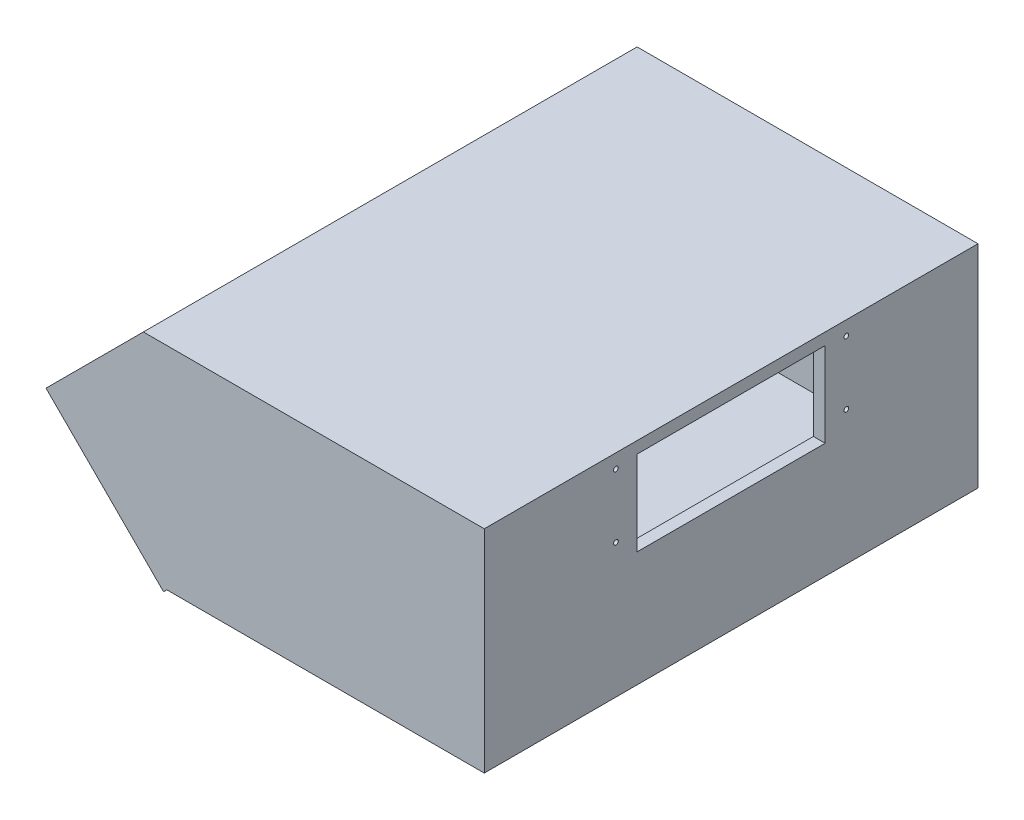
ISO-10303-21;
HEADER;
FILE_DESCRIPTION(('STEP AP214'),'2;1');
FILE_NAME('part.step','',(''),(''),'','','');
FILE_SCHEMA(('AUTOMOTIVE_DESIGN { 1 0 10303 214 1 1 1 1 }'));
ENDSEC;
DATA;
#1=APPLICATION_CONTEXT('core data for automotive mechanical design processes');
#2=APPLICATION_PROTOCOL_DEFINITION('international standard','automotive_design',2000,#1);
#3=PRODUCT_CONTEXT('',#1,'mechanical');
#4=PRODUCT('Part','Part','',(#3));
#5=PRODUCT_RELATED_PRODUCT_CATEGORY('part','',(#4));
#6=PRODUCT_DEFINITION_FORMATION('','',#4);
#7=PRODUCT_DEFINITION_CONTEXT('part definition',#1,'design');
#8=PRODUCT_DEFINITION('design','',#6,#7);
#9=PRODUCT_DEFINITION_SHAPE('','',#8);
#10=(LENGTH_UNIT() NAMED_UNIT(*) SI_UNIT(.MILLI.,.METRE.));
#11=(NAMED_UNIT(*) PLANE_ANGLE_UNIT() SI_UNIT($,.RADIAN.));
#12=(NAMED_UNIT(*) SI_UNIT($,.STERADIAN.) SOLID_ANGLE_UNIT());
#13=UNCERTAINTY_MEASURE_WITH_UNIT(LENGTH_MEASURE(1.E-05),#10,'distance_accuracy_value','');
#14=(GEOMETRIC_REPRESENTATION_CONTEXT(3) GLOBAL_UNCERTAINTY_ASSIGNED_CONTEXT((#13)) GLOBAL_UNIT_ASSIGNED_CONTEXT((#10,
#11,#12)) REPRESENTATION_CONTEXT('',''));
#15=CARTESIAN_POINT('',(0.,0.,0.));
#16=DIRECTION('',(0.,0.,1.));
#17=DIRECTION('',(1.,0.,0.));
#18=AXIS2_PLACEMENT_3D('',#15,#16,#17);
#19=CARTESIAN_POINT('',(180.,87.6256799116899,90.6250000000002));
#20=DIRECTION('',(0.,0.,-1.));
#21=DIRECTION('',(0.,1.,0.));
#22=AXIS2_PLACEMENT_3D('',#19,#20,#21);
#23=PLANE('',#22);
#24=DIRECTION('',(-1.,0.,0.));
#25=VECTOR('',#24,1.);
#26=CARTESIAN_POINT('',(180.,7.62567991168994,90.6250000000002));
#27=LINE('',#26,#25);
#28=CARTESIAN_POINT('',(180.,7.62567991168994,90.6250000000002));
#29=VERTEX_POINT('',#28);
#30=CARTESIAN_POINT('',(50.0000000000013,7.62567991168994,90.6250000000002));
#31=VERTEX_POINT('',#30);
#32=EDGE_CURVE('E305',#29,#31,#27,.T.);
#33=ORIENTED_EDGE('',*,*,#32,.T.);
#34=CARTESIAN_POINT('',(50.0000000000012,2.62567991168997,90.6250000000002));
#35=DIRECTION('',(0.,0.,-1.));
#36=DIRECTION('',(0.,1.,0.));
#37=AXIS2_PLACEMENT_3D('',#34,#35,#36);
#38=CIRCLE('',#37,5.);
#39=CARTESIAN_POINT('',(46.4644660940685,6.16121381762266,90.6250000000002));
#40=VERTEX_POINT('',#39);
#41=EDGE_CURVE('E41',#31,#40,#38,.F.);
#42=ORIENTED_EDGE('',*,*,#41,.T.);
#43=DIRECTION('',(0.707106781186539,0.707106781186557,0.));
#44=VECTOR('',#43,1.);
#45=CARTESIAN_POINT('',(45.0502525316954,4.74700025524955,90.6250000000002));
#46=LINE('',#45,#44);
#47=CARTESIAN_POINT('',(45.0502525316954,4.74700025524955,90.6250000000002));
#48=VERTEX_POINT('',#47);
#49=EDGE_CURVE('E183',#48,#40,#46,.T.);
#50=ORIENTED_EDGE('',*,*,#49,.F.);
#51=DIRECTION('',(-0.707106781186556,0.707106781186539,0.));
#52=VECTOR('',#51,1.);
#53=CARTESIAN_POINT('',(2.12132034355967,47.6759324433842,90.6250000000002));
#54=LINE('',#53,#52);
#55=CARTESIAN_POINT('',(2.12132034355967,47.6759324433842,90.6250000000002));
#56=VERTEX_POINT('',#55);
#57=EDGE_CURVE('E180',#48,#56,#54,.T.);
#58=ORIENTED_EDGE('',*,*,#57,.T.);
#59=DIRECTION('',(0.707106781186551,0.707106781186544,0.));
#60=VECTOR('',#59,1.);
#61=CARTESIAN_POINT('',(111.035533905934,156.590146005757,90.6250000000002));
#62=LINE('',#61,#60);
#63=CARTESIAN_POINT('',(42.0710678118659,87.6256799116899,90.6250000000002));
#64=VERTEX_POINT('',#63);
#65=EDGE_CURVE('E163',#56,#64,#62,.T.);
#66=ORIENTED_EDGE('',*,*,#65,.T.);
#67=DIRECTION('',(-1.,0.,0.));
#68=VECTOR('',#67,1.);
#69=CARTESIAN_POINT('',(180.,87.6256799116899,90.6250000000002));
#70=LINE('',#69,#68);
#71=CARTESIAN_POINT('',(180.,87.6256799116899,90.6250000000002));
#72=VERTEX_POINT('',#71);
#73=EDGE_CURVE('E295',#72,#64,#70,.T.);
#74=ORIENTED_EDGE('',*,*,#73,.F.);
#75=DIRECTION('',(0.,-1.,0.));
#76=VECTOR('',#75,1.);
#77=CARTESIAN_POINT('',(180.,87.6256799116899,90.6250000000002));
#78=LINE('',#77,#76);
#79=EDGE_CURVE('E282',#72,#29,#78,.T.);
#80=ORIENTED_EDGE('',*,*,#79,.T.);
#81=EDGE_LOOP('',(#33,#42,#50,#58,#66,#74,#80));
#82=FACE_BOUND('',#81,.T.);
#83=ADVANCED_FACE('F33',(#82),#23,.T.);
#84=CARTESIAN_POINT('',(180.,87.6256799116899,-109.375));
#85=DIRECTION('',(0.,0.,1.));
#86=DIRECTION('',(0.,-1.,0.));
#87=AXIS2_PLACEMENT_3D('',#84,#85,#86);
#88=PLANE('',#87);
#89=DIRECTION('',(-1.,0.,0.));
#90=VECTOR('',#89,1.);
#91=CARTESIAN_POINT('',(180.,87.6256799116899,-109.375));
#92=LINE('',#91,#90);
#93=CARTESIAN_POINT('',(180.,87.6256799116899,-109.375));
#94=VERTEX_POINT('',#93);
#95=CARTESIAN_POINT('',(42.0710678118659,87.6256799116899,-109.375));
#96=VERTEX_POINT('',#95);
#97=EDGE_CURVE('E299',#94,#96,#92,.T.);
#98=ORIENTED_EDGE('',*,*,#97,.T.);
#99=DIRECTION('',(-0.707106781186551,-0.707106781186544,0.));
#100=VECTOR('',#99,1.);
#101=CARTESIAN_POINT('',(111.035533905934,156.590146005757,-109.375));
#102=LINE('',#101,#100);
#103=CARTESIAN_POINT('',(3.53553390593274,49.0901460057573,-109.375));
#104=VERTEX_POINT('',#103);
#105=EDGE_CURVE('E176',#96,#104,#102,.T.);
#106=ORIENTED_EDGE('',*,*,#105,.T.);
#107=DIRECTION('',(0.707106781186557,-0.707106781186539,0.));
#108=VECTOR('',#107,1.);
#109=CARTESIAN_POINT('',(72.5000000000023,-19.8743200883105,-109.375));
#110=LINE('',#109,#108);
#111=CARTESIAN_POINT('',(46.4644660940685,6.16121381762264,-109.375));
#112=VERTEX_POINT('',#111);
#113=EDGE_CURVE('E231',#104,#112,#110,.T.);
#114=ORIENTED_EDGE('',*,*,#113,.T.);
#115=CARTESIAN_POINT('',(50.0000000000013,2.62567991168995,-109.375));
#116=DIRECTION('',(0.,0.,1.));
#117=DIRECTION('',(0.,-1.,0.));
#118=AXIS2_PLACEMENT_3D('',#115,#116,#117);
#119=CIRCLE('',#118,5.);
#120=CARTESIAN_POINT('',(50.0000000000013,7.62567991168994,-109.375));
#121=VERTEX_POINT('',#120);
#122=EDGE_CURVE('E11',#112,#121,#119,.F.);
#123=ORIENTED_EDGE('',*,*,#122,.T.);
#124=DIRECTION('',(-1.,0.,0.));
#125=VECTOR('',#124,1.);
#126=CARTESIAN_POINT('',(180.,7.62567991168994,-109.375));
#127=LINE('',#126,#125);
#128=CARTESIAN_POINT('',(180.,7.62567991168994,-109.375));
#129=VERTEX_POINT('',#128);
#130=EDGE_CURVE('E302',#129,#121,#127,.T.);
#131=ORIENTED_EDGE('',*,*,#130,.F.);
#132=DIRECTION('',(0.,1.,0.));
#133=VECTOR('',#132,1.);
#134=CARTESIAN_POINT('',(180.,87.6256799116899,-109.375));
#135=LINE('',#134,#133);
#136=EDGE_CURVE('E288',#129,#94,#135,.T.);
#137=ORIENTED_EDGE('',*,*,#136,.T.);
#138=EDGE_LOOP('',(#98,#106,#114,#123,#131,#137));
#139=FACE_BOUND('',#138,.T.);
#140=ADVANCED_FACE('F331',(#139),#88,.T.);
#141=CARTESIAN_POINT('',(180.,87.6256799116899,90.6250000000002));
#142=DIRECTION('',(0.,-1.,0.));
#143=DIRECTION('',(0.,0.,-1.));
#144=AXIS2_PLACEMENT_3D('',#141,#142,#143);
#145=PLANE('',#144);
#146=ORIENTED_EDGE('',*,*,#73,.T.);
#147=DIRECTION('',(0.,0.,-1.));
#148=VECTOR('',#147,1.);
#149=CARTESIAN_POINT('',(42.0710678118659,87.6256799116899,90.6250000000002));
#150=LINE('',#149,#148);
#151=EDGE_CURVE('E171',#64,#96,#150,.T.);
#152=ORIENTED_EDGE('',*,*,#151,.T.);
#153=ORIENTED_EDGE('',*,*,#97,.F.);
#154=DIRECTION('',(0.,0.,1.));
#155=VECTOR('',#154,1.);
#156=CARTESIAN_POINT('',(180.,87.6256799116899,90.6250000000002));
#157=LINE('',#156,#155);
#158=CARTESIAN_POINT('',(180.,87.6256799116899,-58.3749999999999));
#159=VERTEX_POINT('',#158);
#160=EDGE_CURVE('E292',#94,#159,#157,.T.);
#161=ORIENTED_EDGE('',*,*,#160,.T.);
#162=CARTESIAN_POINT('',(180.,87.6256799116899,-49.3749999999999));
#163=VERTEX_POINT('',#162);
#164=EDGE_CURVE('E296',#159,#163,#157,.T.);
#165=ORIENTED_EDGE('',*,*,#164,.T.);
#166=DIRECTION('',(1.,0.,0.));
#167=VECTOR('',#166,1.);
#168=CARTESIAN_POINT('',(-0.001000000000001,87.6256799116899,-49.3749999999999));
#169=LINE('',#168,#167);
#170=CARTESIAN_POINT('',(185.,87.6256799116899,-49.3749999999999));
#171=VERTEX_POINT('',#170);
#172=EDGE_CURVE('E262',#163,#171,#169,.T.);
#173=ORIENTED_EDGE('',*,*,#172,.T.);
#174=DIRECTION('',(0.,0.,1.));
#175=VECTOR('',#174,1.);
#176=CARTESIAN_POINT('',(185.,87.6256799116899,30.6250000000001));
#177=LINE('',#176,#175);
#178=CARTESIAN_POINT('',(185.,87.6256799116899,30.6250000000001));
#179=VERTEX_POINT('',#178);
#180=EDGE_CURVE('E255',#171,#179,#177,.T.);
#181=ORIENTED_EDGE('',*,*,#180,.T.);
#182=DIRECTION('',(1.,0.,0.));
#183=VECTOR('',#182,1.);
#184=CARTESIAN_POINT('',(-0.001000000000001,87.6256799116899,30.6250000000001));
#185=LINE('',#184,#183);
#186=CARTESIAN_POINT('',(180.,87.6256799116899,30.6250000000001));
#187=VERTEX_POINT('',#186);
#188=EDGE_CURVE('E259',#187,#179,#185,.T.);
#189=ORIENTED_EDGE('',*,*,#188,.F.);
#190=CARTESIAN_POINT('',(180.,87.6256799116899,39.6250000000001));
#191=VERTEX_POINT('',#190);
#192=EDGE_CURVE('E297',#187,#191,#157,.T.);
#193=ORIENTED_EDGE('',*,*,#192,.T.);
#194=EDGE_CURVE('E291',#191,#72,#157,.T.);
#195=ORIENTED_EDGE('',*,*,#194,.T.);
#196=EDGE_LOOP('',(#146,#152,#153,#161,#165,#173,#181,#189,#193,#195));
#197=FACE_BOUND('',#196,.T.);
#198=ADVANCED_FACE('F340',(#197),#145,.T.);
#199=CARTESIAN_POINT('',(180.,92.6256799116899,95.6250000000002));
#200=DIRECTION('',(0.,0.,-1.));
#201=DIRECTION('',(0.,1.,0.));
#202=AXIS2_PLACEMENT_3D('',#199,#200,#201);
#203=PLANE('',#202);
#204=DIRECTION('',(-1.,0.,0.));
#205=VECTOR('',#204,1.);
#206=CARTESIAN_POINT('',(180.,92.6256799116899,95.6250000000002));
#207=LINE('',#206,#205);
#208=CARTESIAN_POINT('',(185.,92.6256799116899,95.6250000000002));
#209=VERTEX_POINT('',#208);
#210=CARTESIAN_POINT('',(40.0000000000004,92.62567991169,95.6250000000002));
#211=VERTEX_POINT('',#210);
#212=EDGE_CURVE('E307',#209,#211,#207,.T.);
#213=ORIENTED_EDGE('',*,*,#212,.T.);
#214=DIRECTION('',(-0.707106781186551,-0.707106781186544,0.));
#215=VECTOR('',#214,1.);
#216=CARTESIAN_POINT('',(-26.312839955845,26.3128399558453,95.6250000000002));
#217=LINE('',#216,#215);
#218=CARTESIAN_POINT('',(-1.41421356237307,51.2114663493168,95.6250000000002));
#219=VERTEX_POINT('',#218);
#220=EDGE_CURVE('E233',#211,#219,#217,.T.);
#221=ORIENTED_EDGE('',*,*,#220,.T.);
#222=DIRECTION('',(-0.707106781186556,0.707106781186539,0.));
#223=VECTOR('',#222,1.);
#224=CARTESIAN_POINT('',(-1.41421356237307,51.2114663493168,95.6250000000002));
#225=LINE('',#224,#223);
#226=CARTESIAN_POINT('',(48.5857864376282,1.21146634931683,95.6250000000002));
#227=VERTEX_POINT('',#226);
#228=EDGE_CURVE('E211',#227,#219,#225,.T.);
#229=ORIENTED_EDGE('',*,*,#228,.F.);
#230=DIRECTION('',(0.707106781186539,0.707106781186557,0.));
#231=VECTOR('',#230,1.);
#232=CARTESIAN_POINT('',(48.5857864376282,1.21146634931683,95.6250000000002));
#233=LINE('',#232,#231);
#234=CARTESIAN_POINT('',(50.0000000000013,2.62567991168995,95.6250000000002));
#235=VERTEX_POINT('',#234);
#236=EDGE_CURVE('E221',#227,#235,#233,.T.);
#237=ORIENTED_EDGE('',*,*,#236,.T.);
#238=DIRECTION('',(-1.,0.,0.));
#239=VECTOR('',#238,1.);
#240=CARTESIAN_POINT('',(180.,2.62567991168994,95.6250000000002));
#241=LINE('',#240,#239);
#242=CARTESIAN_POINT('',(185.,2.62567991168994,95.6250000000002));
#243=VERTEX_POINT('',#242);
#244=EDGE_CURVE('E316',#243,#235,#241,.T.);
#245=ORIENTED_EDGE('',*,*,#244,.F.);
#246=DIRECTION('',(0.,-1.,0.));
#247=VECTOR('',#246,1.);
#248=CARTESIAN_POINT('',(185.,92.6256799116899,95.6250000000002));
#249=LINE('',#248,#247);
#250=EDGE_CURVE('E270',#209,#243,#249,.T.);
#251=ORIENTED_EDGE('',*,*,#250,.F.);
#252=EDGE_LOOP('',(#213,#221,#229,#237,#245,#251));
#253=FACE_BOUND('',#252,.T.);
#254=ADVANCED_FACE('F418',(#253),#203,.F.);
#255=CARTESIAN_POINT('',(180.,92.6256799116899,-114.375));
#256=DIRECTION('',(0.,0.,1.));
#257=DIRECTION('',(0.,-1.,0.));
#258=AXIS2_PLACEMENT_3D('',#255,#256,#257);
#259=PLANE('',#258);
#260=DIRECTION('',(0.707106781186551,0.707106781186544,0.));
#261=VECTOR('',#260,1.);
#262=CARTESIAN_POINT('',(-26.312839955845,26.3128399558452,-114.375));
#263=LINE('',#262,#261);
#264=CARTESIAN_POINT('',(-1.41421356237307,51.2114663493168,-114.375));
#265=VERTEX_POINT('',#264);
#266=CARTESIAN_POINT('',(40.0000000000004,92.6256799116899,-114.375));
#267=VERTEX_POINT('',#266);
#268=EDGE_CURVE('E234',#265,#267,#263,.T.);
#269=ORIENTED_EDGE('',*,*,#268,.T.);
#270=DIRECTION('',(-1.,0.,0.));
#271=VECTOR('',#270,1.);
#272=CARTESIAN_POINT('',(180.,92.6256799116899,-114.375));
#273=LINE('',#272,#271);
#274=CARTESIAN_POINT('',(185.,92.6256799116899,-114.375));
#275=VERTEX_POINT('',#274);
#276=EDGE_CURVE('E310',#275,#267,#273,.T.);
#277=ORIENTED_EDGE('',*,*,#276,.F.);
#278=DIRECTION('',(0.,1.,0.));
#279=VECTOR('',#278,1.);
#280=CARTESIAN_POINT('',(185.,92.6256799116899,-114.375));
#281=LINE('',#280,#279);
#282=CARTESIAN_POINT('',(185.,2.62567991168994,-114.375));
#283=VERTEX_POINT('',#282);
#284=EDGE_CURVE('E276',#283,#275,#281,.T.);
#285=ORIENTED_EDGE('',*,*,#284,.F.);
#286=DIRECTION('',(-1.,0.,0.));
#287=VECTOR('',#286,1.);
#288=CARTESIAN_POINT('',(180.,2.62567991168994,-114.375));
#289=LINE('',#288,#287);
#290=CARTESIAN_POINT('',(50.0000000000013,2.62567991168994,-114.375));
#291=VERTEX_POINT('',#290);
#292=EDGE_CURVE('E313',#283,#291,#289,.T.);
#293=ORIENTED_EDGE('',*,*,#292,.T.);
#294=DIRECTION('',(0.707106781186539,0.707106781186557,0.));
#295=VECTOR('',#294,1.);
#296=CARTESIAN_POINT('',(48.5857864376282,1.21146634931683,-114.375));
#297=LINE('',#296,#295);
#298=CARTESIAN_POINT('',(48.5857864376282,1.21146634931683,-114.375));
#299=VERTEX_POINT('',#298);
#300=EDGE_CURVE('E224',#299,#291,#297,.T.);
#301=ORIENTED_EDGE('',*,*,#300,.F.);
#302=DIRECTION('',(0.707106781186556,-0.707106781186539,0.));
#303=VECTOR('',#302,1.);
#304=CARTESIAN_POINT('',(-1.41421356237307,51.2114663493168,-114.375));
#305=LINE('',#304,#303);
#306=EDGE_CURVE('E217',#265,#299,#305,.T.);
#307=ORIENTED_EDGE('',*,*,#306,.F.);
#308=EDGE_LOOP('',(#269,#277,#285,#293,#301,#307));
#309=FACE_BOUND('',#308,.T.);
#310=ADVANCED_FACE('F414',(#309),#259,.F.);
#311=CARTESIAN_POINT('',(180.,2.62567991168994,95.6250000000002));
#312=DIRECTION('',(0.,1.,0.));
#313=DIRECTION('',(0.,0.,1.));
#314=AXIS2_PLACEMENT_3D('',#311,#312,#313);
#315=PLANE('',#314);
#316=DIRECTION('',(0.,0.,1.));
#317=VECTOR('',#316,1.);
#318=CARTESIAN_POINT('',(50.0000000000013,2.62567991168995,-185.085678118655));
#319=LINE('',#318,#317);
#320=EDGE_CURVE('E175',#291,#235,#319,.T.);
#321=ORIENTED_EDGE('',*,*,#320,.F.);
#322=ORIENTED_EDGE('',*,*,#292,.F.);
#323=DIRECTION('',(0.,0.,-1.));
#324=VECTOR('',#323,1.);
#325=CARTESIAN_POINT('',(185.,2.62567991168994,95.6250000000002));
#326=LINE('',#325,#324);
#327=EDGE_CURVE('E273',#243,#283,#326,.T.);
#328=ORIENTED_EDGE('',*,*,#327,.F.);
#329=ORIENTED_EDGE('',*,*,#244,.T.);
#330=EDGE_LOOP('',(#321,#322,#328,#329));
#331=FACE_BOUND('',#330,.T.);
#332=ADVANCED_FACE('F417',(#331),#315,.F.);
#333=CARTESIAN_POINT('',(180.,7.62567991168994,90.6250000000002));
#334=DIRECTION('',(0.,1.,0.));
#335=DIRECTION('',(0.,0.,1.));
#336=AXIS2_PLACEMENT_3D('',#333,#334,#335);
#337=PLANE('',#336);
#338=ORIENTED_EDGE('',*,*,#130,.T.);
#339=DIRECTION('',(0.,0.,1.));
#340=VECTOR('',#339,1.);
#341=CARTESIAN_POINT('',(50.0000000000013,7.62567991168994,-185.085678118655));
#342=LINE('',#341,#340);
#343=EDGE_CURVE('E318',#121,#31,#342,.T.);
#344=ORIENTED_EDGE('',*,*,#343,.T.);
#345=ORIENTED_EDGE('',*,*,#32,.F.);
#346=DIRECTION('',(0.,0.,-1.));
#347=VECTOR('',#346,1.);
#348=CARTESIAN_POINT('',(180.,7.62567991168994,90.6250000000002));
#349=LINE('',#348,#347);
#350=EDGE_CURVE('E285',#29,#129,#349,.T.);
#351=ORIENTED_EDGE('',*,*,#350,.T.);
#352=EDGE_LOOP('',(#338,#344,#345,#351));
#353=FACE_BOUND('',#352,.T.);
#354=ADVANCED_FACE('F334',(#353),#337,.T.);
#355=CARTESIAN_POINT('',(180.,92.6256799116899,95.6250000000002));
#356=DIRECTION('',(0.,-1.,0.));
#357=DIRECTION('',(0.,0.,-1.));
#358=AXIS2_PLACEMENT_3D('',#355,#356,#357);
#359=PLANE('',#358);
#360=DIRECTION('',(0.,0.,1.));
#361=VECTOR('',#360,1.);
#362=CARTESIAN_POINT('',(40.0000000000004,92.62567991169,-185.085678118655));
#363=LINE('',#362,#361);
#364=EDGE_CURVE('E238',#267,#211,#363,.T.);
#365=ORIENTED_EDGE('',*,*,#364,.T.);
#366=ORIENTED_EDGE('',*,*,#212,.F.);
#367=DIRECTION('',(0.,0.,1.));
#368=VECTOR('',#367,1.);
#369=CARTESIAN_POINT('',(185.,92.6256799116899,95.6250000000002));
#370=LINE('',#369,#368);
#371=EDGE_CURVE('E279',#275,#209,#370,.T.);
#372=ORIENTED_EDGE('',*,*,#371,.F.);
#373=ORIENTED_EDGE('',*,*,#276,.T.);
#374=EDGE_LOOP('',(#365,#366,#372,#373));
#375=FACE_BOUND('',#374,.T.);
#376=ADVANCED_FACE('F410',(#375),#359,.F.);
#377=CARTESIAN_POINT('',(180.,0.,0.));
#378=DIRECTION('',(1.,0.,0.));
#379=DIRECTION('',(0.,0.,-1.));
#380=AXIS2_PLACEMENT_3D('',#377,#378,#379);
#381=PLANE('',#380);
#382=CARTESIAN_POINT('',(180.,59.62567991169,39.6250000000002));
#383=DIRECTION('',(1.,0.,0.));
#384=DIRECTION('',(0.,0.,-1.));
#385=AXIS2_PLACEMENT_3D('',#382,#383,#384);
#386=CIRCLE('',#385,0.999999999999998);
#387=CARTESIAN_POINT('',(180.,59.62567991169,38.6250000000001));
#388=VERTEX_POINT('',#387);
#389=EDGE_CURVE('E367',#388,#388,#386,.F.);
#390=ORIENTED_EDGE('',*,*,#389,.F.);
#391=EDGE_LOOP('',(#390));
#392=FACE_BOUND('',#391,.T.);
#393=CARTESIAN_POINT('',(180.,59.6256799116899,-58.3749999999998));
#394=DIRECTION('',(1.,0.,0.));
#395=DIRECTION('',(0.,0.,-1.));
#396=AXIS2_PLACEMENT_3D('',#393,#394,#395);
#397=CIRCLE('',#396,0.999999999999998);
#398=CARTESIAN_POINT('',(180.,59.6256799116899,-59.3749999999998));
#399=VERTEX_POINT('',#398);
#400=EDGE_CURVE('E375',#399,#399,#397,.F.);
#401=ORIENTED_EDGE('',*,*,#400,.F.);
#402=EDGE_LOOP('',(#401));
#403=FACE_BOUND('',#402,.T.);
#404=ORIENTED_EDGE('',*,*,#194,.F.);
#405=CARTESIAN_POINT('',(180.,86.62567991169,39.6250000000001));
#406=DIRECTION('',(1.,0.,0.));
#407=DIRECTION('',(0.,0.,-1.));
#408=AXIS2_PLACEMENT_3D('',#405,#406,#407);
#409=CIRCLE('',#408,0.999999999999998);
#410=EDGE_CURVE('E46',#191,#191,#409,.F.);
#411=ORIENTED_EDGE('',*,*,#410,.F.);
#412=ORIENTED_EDGE('',*,*,#192,.F.);
#413=DIRECTION('',(0.,1.,0.));
#414=VECTOR('',#413,1.);
#415=CARTESIAN_POINT('',(180.,87.6256799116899,30.6250000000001));
#416=LINE('',#415,#414);
#417=CARTESIAN_POINT('',(180.,51.6256799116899,30.6250000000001));
#418=VERTEX_POINT('',#417);
#419=EDGE_CURVE('E244',#418,#187,#416,.T.);
#420=ORIENTED_EDGE('',*,*,#419,.F.);
#421=DIRECTION('',(0.,0.,1.));
#422=VECTOR('',#421,1.);
#423=CARTESIAN_POINT('',(180.,51.6256799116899,30.6250000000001));
#424=LINE('',#423,#422);
#425=CARTESIAN_POINT('',(180.,51.6256799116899,-49.3749999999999));
#426=VERTEX_POINT('',#425);
#427=EDGE_CURVE('E261',#426,#418,#424,.T.);
#428=ORIENTED_EDGE('',*,*,#427,.F.);
#429=DIRECTION('',(0.,-1.,0.));
#430=VECTOR('',#429,1.);
#431=CARTESIAN_POINT('',(180.,87.6256799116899,-49.3749999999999));
#432=LINE('',#431,#430);
#433=EDGE_CURVE('E237',#163,#426,#432,.T.);
#434=ORIENTED_EDGE('',*,*,#433,.F.);
#435=ORIENTED_EDGE('',*,*,#164,.F.);
#436=CARTESIAN_POINT('',(180.,86.6256799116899,-58.3749999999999));
#437=DIRECTION('',(1.,0.,0.));
#438=DIRECTION('',(0.,0.,-1.));
#439=AXIS2_PLACEMENT_3D('',#436,#437,#438);
#440=CIRCLE('',#439,0.999999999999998);
#441=EDGE_CURVE('E51',#159,#159,#440,.F.);
#442=ORIENTED_EDGE('',*,*,#441,.F.);
#443=ORIENTED_EDGE('',*,*,#160,.F.);
#444=ORIENTED_EDGE('',*,*,#136,.F.);
#445=ORIENTED_EDGE('',*,*,#350,.F.);
#446=ORIENTED_EDGE('',*,*,#79,.F.);
#447=EDGE_LOOP('',(#404,#411,#412,#420,#428,#434,#435,#442,#443,#444,#445,#446));
#448=FACE_BOUND('',#447,.T.);
#449=ADVANCED_FACE('F338',(#392,#403,#448),#381,.F.);
#450=CARTESIAN_POINT('',(185.,0.,0.));
#451=DIRECTION('',(1.,0.,0.));
#452=DIRECTION('',(0.,0.,-1.));
#453=AXIS2_PLACEMENT_3D('',#450,#451,#452);
#454=PLANE('',#453);
#455=CARTESIAN_POINT('',(185.,86.62567991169,39.6250000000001));
#456=DIRECTION('',(1.,0.,0.));
#457=DIRECTION('',(0.,0.,-1.));
#458=AXIS2_PLACEMENT_3D('',#455,#456,#457);
#459=CIRCLE('',#458,0.999999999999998);
#460=CARTESIAN_POINT('',(185.,86.62567991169,38.6250000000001));
#461=VERTEX_POINT('',#460);
#462=EDGE_CURVE('E363',#461,#461,#459,.T.);
#463=ORIENTED_EDGE('',*,*,#462,.F.);
#464=EDGE_LOOP('',(#463));
#465=FACE_BOUND('',#464,.T.);
#466=CARTESIAN_POINT('',(185.,59.62567991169,39.6250000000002));
#467=DIRECTION('',(1.,0.,0.));
#468=DIRECTION('',(0.,0.,-1.));
#469=AXIS2_PLACEMENT_3D('',#466,#467,#468);
#470=CIRCLE('',#469,0.999999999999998);
#471=CARTESIAN_POINT('',(185.,59.62567991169,38.6250000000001));
#472=VERTEX_POINT('',#471);
#473=EDGE_CURVE('E372',#472,#472,#470,.T.);
#474=ORIENTED_EDGE('',*,*,#473,.F.);
#475=EDGE_LOOP('',(#474));
#476=FACE_BOUND('',#475,.T.);
#477=CARTESIAN_POINT('',(185.,59.6256799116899,-58.3749999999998));
#478=DIRECTION('',(1.,0.,0.));
#479=DIRECTION('',(0.,0.,-1.));
#480=AXIS2_PLACEMENT_3D('',#477,#478,#479);
#481=CIRCLE('',#480,0.999999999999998);
#482=CARTESIAN_POINT('',(185.,59.6256799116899,-59.3749999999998));
#483=VERTEX_POINT('',#482);
#484=EDGE_CURVE('E378',#483,#483,#481,.T.);
#485=ORIENTED_EDGE('',*,*,#484,.F.);
#486=EDGE_LOOP('',(#485));
#487=FACE_BOUND('',#486,.T.);
#488=CARTESIAN_POINT('',(185.,86.6256799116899,-58.3749999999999));
#489=DIRECTION('',(1.,0.,0.));
#490=DIRECTION('',(0.,0.,-1.));
#491=AXIS2_PLACEMENT_3D('',#488,#489,#490);
#492=CIRCLE('',#491,0.999999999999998);
#493=CARTESIAN_POINT('',(185.,86.6256799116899,-59.3749999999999));
#494=VERTEX_POINT('',#493);
#495=EDGE_CURVE('E362',#494,#494,#492,.T.);
#496=ORIENTED_EDGE('',*,*,#495,.F.);
#497=EDGE_LOOP('',(#496));
#498=FACE_BOUND('',#497,.T.);
#499=DIRECTION('',(0.,-1.,0.));
#500=VECTOR('',#499,1.);
#501=CARTESIAN_POINT('',(185.,87.6256799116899,30.6250000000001));
#502=LINE('',#501,#500);
#503=CARTESIAN_POINT('',(185.,51.6256799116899,30.6250000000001));
#504=VERTEX_POINT('',#503);
#505=EDGE_CURVE('E247',#179,#504,#502,.T.);
#506=ORIENTED_EDGE('',*,*,#505,.F.);
#507=ORIENTED_EDGE('',*,*,#180,.F.);
#508=DIRECTION('',(0.,1.,0.));
#509=VECTOR('',#508,1.);
#510=CARTESIAN_POINT('',(185.,87.6256799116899,-49.3749999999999));
#511=LINE('',#510,#509);
#512=CARTESIAN_POINT('',(185.,51.6256799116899,-49.3749999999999));
#513=VERTEX_POINT('',#512);
#514=EDGE_CURVE('E252',#513,#171,#511,.T.);
#515=ORIENTED_EDGE('',*,*,#514,.F.);
#516=DIRECTION('',(0.,0.,-1.));
#517=VECTOR('',#516,1.);
#518=CARTESIAN_POINT('',(185.,51.6256799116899,30.6250000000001));
#519=LINE('',#518,#517);
#520=EDGE_CURVE('E249',#504,#513,#519,.T.);
#521=ORIENTED_EDGE('',*,*,#520,.F.);
#522=EDGE_LOOP('',(#506,#507,#515,#521));
#523=FACE_BOUND('',#522,.T.);
#524=ORIENTED_EDGE('',*,*,#250,.T.);
#525=ORIENTED_EDGE('',*,*,#327,.T.);
#526=ORIENTED_EDGE('',*,*,#284,.T.);
#527=ORIENTED_EDGE('',*,*,#371,.T.);
#528=EDGE_LOOP('',(#524,#525,#526,#527));
#529=FACE_BOUND('',#528,.T.);
#530=ADVANCED_FACE('F358',(#465,#476,#487,#498,#523,#529),#454,.T.);
#531=CARTESIAN_POINT('',(-0.001000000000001,87.6256799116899,30.6250000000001));
#532=DIRECTION('',(0.,0.,1.));
#533=DIRECTION('',(1.,0.,0.));
#534=AXIS2_PLACEMENT_3D('',#531,#532,#533);
#535=PLANE('',#534);
#536=ORIENTED_EDGE('',*,*,#419,.T.);
#537=ORIENTED_EDGE('',*,*,#188,.T.);
#538=ORIENTED_EDGE('',*,*,#505,.T.);
#539=DIRECTION('',(1.,0.,0.));
#540=VECTOR('',#539,1.);
#541=CARTESIAN_POINT('',(-0.001000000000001,51.6256799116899,30.6250000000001));
#542=LINE('',#541,#540);
#543=EDGE_CURVE('E258',#418,#504,#542,.T.);
#544=ORIENTED_EDGE('',*,*,#543,.F.);
#545=EDGE_LOOP('',(#536,#537,#538,#544));
#546=FACE_BOUND('',#545,.T.);
#547=ADVANCED_FACE('F361',(#546),#535,.F.);
#548=CARTESIAN_POINT('',(-0.001000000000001,87.6256799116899,-49.3749999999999));
#549=DIRECTION('',(0.,0.,-1.));
#550=DIRECTION('',(0.,1.,0.));
#551=AXIS2_PLACEMENT_3D('',#548,#549,#550);
#552=PLANE('',#551);
#553=ORIENTED_EDGE('',*,*,#433,.T.);
#554=DIRECTION('',(1.,0.,0.));
#555=VECTOR('',#554,1.);
#556=CARTESIAN_POINT('',(-0.001000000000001,51.6256799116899,-49.3749999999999));
#557=LINE('',#556,#555);
#558=EDGE_CURVE('E264',#426,#513,#557,.T.);
#559=ORIENTED_EDGE('',*,*,#558,.T.);
#560=ORIENTED_EDGE('',*,*,#514,.T.);
#561=ORIENTED_EDGE('',*,*,#172,.F.);
#562=EDGE_LOOP('',(#553,#559,#560,#561));
#563=FACE_BOUND('',#562,.T.);
#564=ADVANCED_FACE('F348',(#563),#552,.F.);
#565=CARTESIAN_POINT('',(-0.001000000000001,51.6256799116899,30.6250000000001));
#566=DIRECTION('',(0.,-1.,0.));
#567=DIRECTION('',(0.,0.,-1.));
#568=AXIS2_PLACEMENT_3D('',#565,#566,#567);
#569=PLANE('',#568);
#570=ORIENTED_EDGE('',*,*,#427,.T.);
#571=ORIENTED_EDGE('',*,*,#543,.T.);
#572=ORIENTED_EDGE('',*,*,#520,.T.);
#573=ORIENTED_EDGE('',*,*,#558,.F.);
#574=EDGE_LOOP('',(#570,#571,#572,#573));
#575=FACE_BOUND('',#574,.T.);
#576=ADVANCED_FACE('F354',(#575),#569,.F.);
#577=CARTESIAN_POINT('',(-26.312839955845,26.3128399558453,-185.085678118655));
#578=DIRECTION('',(-0.707106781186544,0.707106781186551,0.));
#579=DIRECTION('',(-0.707106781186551,-0.707106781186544,0.));
#580=AXIS2_PLACEMENT_3D('',#577,#578,#579);
#581=PLANE('',#580);
#582=ORIENTED_EDGE('',*,*,#268,.F.);
#583=DIRECTION('',(0.,0.,-1.));
#584=VECTOR('',#583,1.);
#585=CARTESIAN_POINT('',(-1.41421356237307,51.2114663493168,95.6250000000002));
#586=LINE('',#585,#584);
#587=EDGE_CURVE('E214',#219,#265,#586,.T.);
#588=ORIENTED_EDGE('',*,*,#587,.F.);
#589=ORIENTED_EDGE('',*,*,#220,.F.);
#590=ORIENTED_EDGE('',*,*,#364,.F.);
#591=EDGE_LOOP('',(#582,#588,#589,#590));
#592=FACE_BOUND('',#591,.T.);
#593=ADVANCED_FACE('F437',(#592),#581,.T.);
#594=CARTESIAN_POINT('',(26.312839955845,26.3128399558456,-185.085678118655));
#595=DIRECTION('',(-0.707106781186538,-0.707106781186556,0.));
#596=DIRECTION('',(0.707106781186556,-0.707106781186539,0.));
#597=AXIS2_PLACEMENT_3D('',#594,#595,#596);
#598=PLANE('',#597);
#599=DIRECTION('',(0.,0.,1.));
#600=VECTOR('',#599,1.);
#601=CARTESIAN_POINT('',(46.4644660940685,6.16121381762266,90.6250000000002));
#602=LINE('',#601,#600);
#603=CARTESIAN_POINT('',(46.4644660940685,6.16121381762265,-110.679530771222));
#604=VERTEX_POINT('',#603);
#605=EDGE_CURVE('E186',#604,#112,#602,.T.);
#606=ORIENTED_EDGE('',*,*,#605,.T.);
#607=ORIENTED_EDGE('',*,*,#113,.F.);
#608=DIRECTION('',(0.,0.,-1.));
#609=VECTOR('',#608,1.);
#610=CARTESIAN_POINT('',(3.53553390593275,49.0901460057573,90.6250000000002));
#611=LINE('',#610,#609);
#612=CARTESIAN_POINT('',(3.53553390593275,49.0901460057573,-110.679530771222));
#613=VERTEX_POINT('',#612);
#614=EDGE_CURVE('E198',#104,#613,#611,.T.);
#615=ORIENTED_EDGE('',*,*,#614,.T.);
#616=DIRECTION('',(0.707106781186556,-0.707106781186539,0.));
#617=VECTOR('',#616,1.);
#618=CARTESIAN_POINT('',(3.53553390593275,49.0901460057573,-110.679530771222));
#619=LINE('',#618,#617);
#620=EDGE_CURVE('E200',#613,#604,#619,.T.);
#621=ORIENTED_EDGE('',*,*,#620,.T.);
#622=EDGE_LOOP('',(#606,#607,#615,#621));
#623=FACE_BOUND('',#622,.T.);
#624=ADVANCED_FACE('F456',(#623),#598,.T.);
#625=CARTESIAN_POINT('',(-22.7773060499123,22.7773060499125,0.));
#626=DIRECTION('',(-0.707106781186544,0.707106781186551,0.));
#627=DIRECTION('',(-0.707106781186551,-0.707106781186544,0.));
#628=AXIS2_PLACEMENT_3D('',#625,#626,#627);
#629=PLANE('',#628);
#630=ORIENTED_EDGE('',*,*,#65,.F.);
#631=DIRECTION('',(0.,0.,-1.));
#632=VECTOR('',#631,1.);
#633=CARTESIAN_POINT('',(2.12132034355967,47.6759324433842,90.6250000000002));
#634=LINE('',#633,#632);
#635=CARTESIAN_POINT('',(2.12132034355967,47.6759324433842,-110.679530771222));
#636=VERTEX_POINT('',#635);
#637=EDGE_CURVE('E168',#56,#636,#634,.T.);
#638=ORIENTED_EDGE('',*,*,#637,.T.);
#639=DIRECTION('',(0.707106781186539,0.707106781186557,0.));
#640=VECTOR('',#639,1.);
#641=CARTESIAN_POINT('',(2.12132034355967,47.6759324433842,-110.679530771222));
#642=LINE('',#641,#640);
#643=EDGE_CURVE('E209',#636,#613,#642,.T.);
#644=ORIENTED_EDGE('',*,*,#643,.T.);
#645=ORIENTED_EDGE('',*,*,#614,.F.);
#646=ORIENTED_EDGE('',*,*,#105,.F.);
#647=ORIENTED_EDGE('',*,*,#151,.F.);
#648=EDGE_LOOP('',(#630,#638,#644,#645,#646,#647));
#649=FACE_BOUND('',#648,.T.);
#650=ADVANCED_FACE('F165',(#649),#629,.F.);
#651=CARTESIAN_POINT('',(24.8986263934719,24.8986263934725,0.));
#652=DIRECTION('',(0.707106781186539,0.707106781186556,0.));
#653=DIRECTION('',(-0.707106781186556,0.707106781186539,0.));
#654=AXIS2_PLACEMENT_3D('',#651,#652,#653);
#655=PLANE('',#654);
#656=ORIENTED_EDGE('',*,*,#228,.T.);
#657=ORIENTED_EDGE('',*,*,#587,.T.);
#658=ORIENTED_EDGE('',*,*,#306,.T.);
#659=DIRECTION('',(0.,0.,1.));
#660=VECTOR('',#659,1.);
#661=CARTESIAN_POINT('',(48.5857864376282,1.21146634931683,95.6250000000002));
#662=LINE('',#661,#660);
#663=EDGE_CURVE('E219',#299,#227,#662,.T.);
#664=ORIENTED_EDGE('',*,*,#663,.T.);
#665=EDGE_LOOP('',(#656,#657,#658,#664));
#666=FACE_BOUND('',#665,.T.);
#667=ORIENTED_EDGE('',*,*,#57,.F.);
#668=DIRECTION('',(0.,0.,1.));
#669=VECTOR('',#668,1.);
#670=CARTESIAN_POINT('',(45.0502525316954,4.74700025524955,90.6250000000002));
#671=LINE('',#670,#669);
#672=CARTESIAN_POINT('',(45.0502525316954,4.74700025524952,-110.679530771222));
#673=VERTEX_POINT('',#672);
#674=EDGE_CURVE('E193',#673,#48,#671,.T.);
#675=ORIENTED_EDGE('',*,*,#674,.F.);
#676=DIRECTION('',(0.707106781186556,-0.707106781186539,0.));
#677=VECTOR('',#676,1.);
#678=CARTESIAN_POINT('',(2.12132034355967,47.6759324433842,-110.679530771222));
#679=LINE('',#678,#677);
#680=EDGE_CURVE('E191',#636,#673,#679,.T.);
#681=ORIENTED_EDGE('',*,*,#680,.F.);
#682=ORIENTED_EDGE('',*,*,#637,.F.);
#683=EDGE_LOOP('',(#667,#675,#681,#682));
#684=FACE_BOUND('',#683,.T.);
#685=ADVANCED_FACE('F189',(#666,#684),#655,.F.);
#686=CARTESIAN_POINT('',(48.5857864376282,1.21146634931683,95.6250000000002));
#687=DIRECTION('',(-0.707106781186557,0.707106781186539,0.));
#688=DIRECTION('',(-0.707106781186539,-0.707106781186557,0.));
#689=AXIS2_PLACEMENT_3D('',#686,#687,#688);
#690=PLANE('',#689);
#691=ORIENTED_EDGE('',*,*,#320,.T.);
#692=ORIENTED_EDGE('',*,*,#236,.F.);
#693=ORIENTED_EDGE('',*,*,#663,.F.);
#694=ORIENTED_EDGE('',*,*,#300,.T.);
#695=EDGE_LOOP('',(#691,#692,#693,#694));
#696=FACE_BOUND('',#695,.T.);
#697=ADVANCED_FACE('F442',(#696),#690,.F.);
#698=CARTESIAN_POINT('',(2.12132034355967,47.6759324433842,-110.679530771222));
#699=DIRECTION('',(0.,0.,1.));
#700=DIRECTION('',(1.,0.,0.));
#701=AXIS2_PLACEMENT_3D('',#698,#699,#700);
#702=PLANE('',#701);
#703=ORIENTED_EDGE('',*,*,#620,.F.);
#704=ORIENTED_EDGE('',*,*,#643,.F.);
#705=ORIENTED_EDGE('',*,*,#680,.T.);
#706=DIRECTION('',(0.707106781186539,0.707106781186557,0.));
#707=VECTOR('',#706,1.);
#708=CARTESIAN_POINT('',(45.0502525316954,4.74700025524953,-110.679530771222));
#709=LINE('',#708,#707);
#710=EDGE_CURVE('E206',#673,#604,#709,.T.);
#711=ORIENTED_EDGE('',*,*,#710,.T.);
#712=EDGE_LOOP('',(#703,#704,#705,#711));
#713=FACE_BOUND('',#712,.T.);
#714=ADVANCED_FACE('F444',(#713),#702,.T.);
#715=CARTESIAN_POINT('',(45.0502525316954,4.74700025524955,90.6250000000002));
#716=DIRECTION('',(-0.707106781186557,0.707106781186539,0.));
#717=DIRECTION('',(-0.707106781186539,-0.707106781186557,0.));
#718=AXIS2_PLACEMENT_3D('',#715,#716,#717);
#719=PLANE('',#718);
#720=ORIENTED_EDGE('',*,*,#605,.F.);
#721=ORIENTED_EDGE('',*,*,#710,.F.);
#722=ORIENTED_EDGE('',*,*,#674,.T.);
#723=ORIENTED_EDGE('',*,*,#49,.T.);
#724=EDGE_CURVE('E202',#112,#40,#602,.T.);
#725=ORIENTED_EDGE('',*,*,#724,.F.);
#726=EDGE_LOOP('',(#720,#721,#722,#723,#725));
#727=FACE_BOUND('',#726,.T.);
#728=ADVANCED_FACE('F327',(#727),#719,.T.);
#729=CARTESIAN_POINT('',(50.0000000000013,2.62567991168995,-185.085678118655));
#730=DIRECTION('',(0.,0.,-1.));
#731=DIRECTION('',(-1.,0.,0.));
#732=AXIS2_PLACEMENT_3D('',#729,#730,#731);
#733=CYLINDRICAL_SURFACE('',#732,5.);
#734=ORIENTED_EDGE('',*,*,#122,.F.);
#735=ORIENTED_EDGE('',*,*,#724,.T.);
#736=ORIENTED_EDGE('',*,*,#41,.F.);
#737=ORIENTED_EDGE('',*,*,#343,.F.);
#738=EDGE_LOOP('',(#734,#735,#736,#737));
#739=FACE_BOUND('',#738,.T.);
#740=ADVANCED_FACE('F35',(#739),#733,.T.);
#741=CARTESIAN_POINT('',(-1.41521356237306,86.6256799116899,-58.3749999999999));
#742=DIRECTION('',(1.,0.,0.));
#743=DIRECTION('',(0.,0.,-1.));
#744=AXIS2_PLACEMENT_3D('',#741,#742,#743);
#745=CYLINDRICAL_SURFACE('',#744,0.999999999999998);
#746=ORIENTED_EDGE('',*,*,#495,.T.);
#747=EDGE_LOOP('',(#746));
#748=FACE_BOUND('',#747,.T.);
#749=ORIENTED_EDGE('',*,*,#441,.T.);
#750=EDGE_LOOP('',(#749));
#751=FACE_BOUND('',#750,.T.);
#752=ADVANCED_FACE('F392',(#748,#751),#745,.F.);
#753=CARTESIAN_POINT('',(-1.41521356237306,59.6256799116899,-58.3749999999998));
#754=DIRECTION('',(1.,0.,0.));
#755=DIRECTION('',(0.,0.,-1.));
#756=AXIS2_PLACEMENT_3D('',#753,#754,#755);
#757=CYLINDRICAL_SURFACE('',#756,0.999999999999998);
#758=CARTESIAN_POINT('',(185.,59.6256799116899,-59.3749999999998));
#759=CARTESIAN_POINT('',(184.947916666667,59.6256799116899,-59.3749999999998));
#760=CARTESIAN_POINT('',(184.895833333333,59.6256799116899,-59.3749999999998));
#761=CARTESIAN_POINT('',(184.791666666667,59.6256799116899,-59.3749999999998));
#762=CARTESIAN_POINT('',(184.739583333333,59.6256799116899,-59.3749999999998));
#763=CARTESIAN_POINT('',(184.635416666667,59.6256799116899,-59.3749999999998));
#764=CARTESIAN_POINT('',(184.583333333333,59.6256799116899,-59.3749999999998));
#765=CARTESIAN_POINT('',(184.479166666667,59.6256799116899,-59.3749999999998));
#766=CARTESIAN_POINT('',(184.427083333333,59.6256799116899,-59.3749999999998));
#767=CARTESIAN_POINT('',(184.322916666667,59.6256799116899,-59.3749999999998));
#768=CARTESIAN_POINT('',(184.270833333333,59.6256799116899,-59.3749999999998));
#769=CARTESIAN_POINT('',(184.166666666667,59.6256799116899,-59.3749999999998));
#770=CARTESIAN_POINT('',(184.114583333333,59.6256799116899,-59.3749999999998));
#771=CARTESIAN_POINT('',(184.010416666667,59.6256799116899,-59.3749999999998));
#772=CARTESIAN_POINT('',(183.958333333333,59.6256799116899,-59.3749999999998));
#773=CARTESIAN_POINT('',(183.854166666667,59.6256799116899,-59.3749999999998));
#774=CARTESIAN_POINT('',(183.802083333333,59.6256799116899,-59.3749999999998));
#775=CARTESIAN_POINT('',(183.697916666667,59.6256799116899,-59.3749999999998));
#776=CARTESIAN_POINT('',(183.645833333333,59.6256799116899,-59.3749999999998));
#777=CARTESIAN_POINT('',(183.541666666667,59.6256799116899,-59.3749999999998));
#778=CARTESIAN_POINT('',(183.489583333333,59.6256799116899,-59.3749999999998));
#779=CARTESIAN_POINT('',(183.385416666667,59.6256799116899,-59.3749999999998));
#780=CARTESIAN_POINT('',(183.333333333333,59.6256799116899,-59.3749999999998));
#781=CARTESIAN_POINT('',(183.229166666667,59.6256799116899,-59.3749999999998));
#782=CARTESIAN_POINT('',(183.177083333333,59.6256799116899,-59.3749999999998));
#783=CARTESIAN_POINT('',(183.072916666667,59.6256799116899,-59.3749999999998));
#784=CARTESIAN_POINT('',(183.020833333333,59.6256799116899,-59.3749999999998));
#785=CARTESIAN_POINT('',(182.916666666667,59.6256799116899,-59.3749999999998));
#786=CARTESIAN_POINT('',(182.864583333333,59.6256799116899,-59.3749999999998));
#787=CARTESIAN_POINT('',(182.760416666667,59.6256799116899,-59.3749999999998));
#788=CARTESIAN_POINT('',(182.708333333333,59.6256799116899,-59.3749999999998));
#789=CARTESIAN_POINT('',(182.604166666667,59.6256799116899,-59.3749999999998));
#790=CARTESIAN_POINT('',(182.552083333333,59.6256799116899,-59.3749999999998));
#791=CARTESIAN_POINT('',(182.447916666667,59.6256799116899,-59.3749999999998));
#792=CARTESIAN_POINT('',(182.395833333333,59.6256799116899,-59.3749999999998));
#793=CARTESIAN_POINT('',(182.291666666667,59.6256799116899,-59.3749999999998));
#794=CARTESIAN_POINT('',(182.239583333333,59.6256799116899,-59.3749999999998));
#795=CARTESIAN_POINT('',(182.135416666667,59.6256799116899,-59.3749999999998));
#796=CARTESIAN_POINT('',(182.083333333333,59.6256799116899,-59.3749999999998));
#797=CARTESIAN_POINT('',(181.979166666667,59.6256799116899,-59.3749999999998));
#798=CARTESIAN_POINT('',(181.927083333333,59.6256799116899,-59.3749999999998));
#799=CARTESIAN_POINT('',(181.822916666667,59.6256799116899,-59.3749999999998));
#800=CARTESIAN_POINT('',(181.770833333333,59.6256799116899,-59.3749999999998));
#801=CARTESIAN_POINT('',(181.666666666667,59.6256799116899,-59.3749999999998));
#802=CARTESIAN_POINT('',(181.614583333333,59.6256799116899,-59.3749999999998));
#803=CARTESIAN_POINT('',(181.510416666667,59.6256799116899,-59.3749999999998));
#804=CARTESIAN_POINT('',(181.458333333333,59.6256799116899,-59.3749999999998));
#805=CARTESIAN_POINT('',(181.354166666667,59.6256799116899,-59.3749999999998));
#806=CARTESIAN_POINT('',(181.302083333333,59.6256799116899,-59.3749999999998));
#807=CARTESIAN_POINT('',(181.197916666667,59.6256799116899,-59.3749999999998));
#808=CARTESIAN_POINT('',(181.145833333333,59.6256799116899,-59.3749999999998));
#809=CARTESIAN_POINT('',(181.041666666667,59.6256799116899,-59.3749999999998));
#810=CARTESIAN_POINT('',(180.989583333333,59.6256799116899,-59.3749999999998));
#811=CARTESIAN_POINT('',(180.885416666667,59.6256799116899,-59.3749999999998));
#812=CARTESIAN_POINT('',(180.833333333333,59.6256799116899,-59.3749999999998));
#813=CARTESIAN_POINT('',(180.729166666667,59.6256799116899,-59.3749999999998));
#814=CARTESIAN_POINT('',(180.677083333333,59.6256799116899,-59.3749999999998));
#815=CARTESIAN_POINT('',(180.572916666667,59.6256799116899,-59.3749999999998));
#816=CARTESIAN_POINT('',(180.520833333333,59.6256799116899,-59.3749999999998));
#817=CARTESIAN_POINT('',(180.416666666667,59.6256799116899,-59.3749999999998));
#818=CARTESIAN_POINT('',(180.364583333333,59.6256799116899,-59.3749999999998));
#819=CARTESIAN_POINT('',(180.260416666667,59.6256799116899,-59.3749999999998));
#820=CARTESIAN_POINT('',(180.208333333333,59.6256799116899,-59.3749999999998));
#821=CARTESIAN_POINT('',(180.104166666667,59.6256799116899,-59.3749999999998));
#822=CARTESIAN_POINT('',(180.052083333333,59.6256799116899,-59.3749999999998));
#823=CARTESIAN_POINT('',(180.,59.6256799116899,-59.3749999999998));
#824=B_SPLINE_CURVE_WITH_KNOTS('',3,(#758,#759,#760,#761,#762,#763,#764,#765,#766,#767,#768,
#769,#770,#771,#772,#773,#774,#775,#776,#777,#778,#779,#780,#781,#782,#783,#784,#785,#786,#787,
#788,#789,#790,#791,#792,#793,#794,#795,#796,#797,#798,#799,#800,#801,#802,#803,#804,#805,#806,
#807,#808,#809,#810,#811,#812,#813,#814,#815,#816,#817,#818,#819,#820,#821,#822,#823),
.UNSPECIFIED.,.F.,.F.,(4,2,2,2,2,2,2,2,2,2,2,2,2,2,2,2,2,2,2,2,2,2,2,2,2,2,2,2,2,2,2,2,4),(0.,
0.156249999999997,0.312499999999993,0.46874999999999,0.624999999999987,0.781250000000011,
0.937500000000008,1.09375,1.25,1.40625,1.56249999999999,1.71874999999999,1.87500000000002,
2.03125000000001,2.18750000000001,2.34375000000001,2.5,2.65625,2.8125,2.96874999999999,
3.12499999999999,3.28125000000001,3.43750000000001,3.59375000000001,3.75,3.90625,4.0625,
4.21874999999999,4.37500000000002,4.53125000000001,4.68750000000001,4.84375000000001,5.),.UNSPECIFIED.);
#825=EDGE_CURVE('BSEAM383',#483,#399,#824,.T.);
#826=ORIENTED_EDGE('',*,*,#484,.T.);
#827=ORIENTED_EDGE('',*,*,#400,.T.);
#828=ORIENTED_EDGE('',*,*,#825,.T.);
#829=ORIENTED_EDGE('',*,*,#825,.F.);
#830=EDGE_LOOP('',(#826,#828,#827,#829));
#831=FACE_BOUND('',#830,.T.);
#832=ADVANCED_FACE('F383',(#831),#757,.F.);
#833=CARTESIAN_POINT('',(-1.41521356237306,59.62567991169,39.6250000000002));
#834=DIRECTION('',(1.,0.,0.));
#835=DIRECTION('',(0.,0.,-1.));
#836=AXIS2_PLACEMENT_3D('',#833,#834,#835);
#837=CYLINDRICAL_SURFACE('',#836,0.999999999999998);
#838=CARTESIAN_POINT('',(185.,59.62567991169,38.6250000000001));
#839=CARTESIAN_POINT('',(184.947916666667,59.62567991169,38.6250000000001));
#840=CARTESIAN_POINT('',(184.895833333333,59.62567991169,38.6250000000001));
#841=CARTESIAN_POINT('',(184.791666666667,59.62567991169,38.6250000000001));
#842=CARTESIAN_POINT('',(184.739583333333,59.62567991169,38.6250000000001));
#843=CARTESIAN_POINT('',(184.635416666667,59.62567991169,38.6250000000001));
#844=CARTESIAN_POINT('',(184.583333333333,59.62567991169,38.6250000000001));
#845=CARTESIAN_POINT('',(184.479166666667,59.62567991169,38.6250000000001));
#846=CARTESIAN_POINT('',(184.427083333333,59.62567991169,38.6250000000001));
#847=CARTESIAN_POINT('',(184.322916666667,59.62567991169,38.6250000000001));
#848=CARTESIAN_POINT('',(184.270833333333,59.62567991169,38.6250000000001));
#849=CARTESIAN_POINT('',(184.166666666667,59.62567991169,38.6250000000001));
#850=CARTESIAN_POINT('',(184.114583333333,59.62567991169,38.6250000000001));
#851=CARTESIAN_POINT('',(184.010416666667,59.62567991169,38.6250000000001));
#852=CARTESIAN_POINT('',(183.958333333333,59.62567991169,38.6250000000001));
#853=CARTESIAN_POINT('',(183.854166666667,59.62567991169,38.6250000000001));
#854=CARTESIAN_POINT('',(183.802083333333,59.62567991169,38.6250000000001));
#855=CARTESIAN_POINT('',(183.697916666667,59.62567991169,38.6250000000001));
#856=CARTESIAN_POINT('',(183.645833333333,59.62567991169,38.6250000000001));
#857=CARTESIAN_POINT('',(183.541666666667,59.62567991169,38.6250000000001));
#858=CARTESIAN_POINT('',(183.489583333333,59.62567991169,38.6250000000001));
#859=CARTESIAN_POINT('',(183.385416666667,59.62567991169,38.6250000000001));
#860=CARTESIAN_POINT('',(183.333333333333,59.62567991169,38.6250000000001));
#861=CARTESIAN_POINT('',(183.229166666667,59.62567991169,38.6250000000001));
#862=CARTESIAN_POINT('',(183.177083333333,59.62567991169,38.6250000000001));
#863=CARTESIAN_POINT('',(183.072916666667,59.62567991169,38.6250000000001));
#864=CARTESIAN_POINT('',(183.020833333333,59.62567991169,38.6250000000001));
#865=CARTESIAN_POINT('',(182.916666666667,59.62567991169,38.6250000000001));
#866=CARTESIAN_POINT('',(182.864583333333,59.62567991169,38.6250000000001));
#867=CARTESIAN_POINT('',(182.760416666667,59.62567991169,38.6250000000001));
#868=CARTESIAN_POINT('',(182.708333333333,59.62567991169,38.6250000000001));
#869=CARTESIAN_POINT('',(182.604166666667,59.62567991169,38.6250000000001));
#870=CARTESIAN_POINT('',(182.552083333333,59.62567991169,38.6250000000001));
#871=CARTESIAN_POINT('',(182.447916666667,59.62567991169,38.6250000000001));
#872=CARTESIAN_POINT('',(182.395833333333,59.62567991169,38.6250000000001));
#873=CARTESIAN_POINT('',(182.291666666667,59.62567991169,38.6250000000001));
#874=CARTESIAN_POINT('',(182.239583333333,59.62567991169,38.6250000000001));
#875=CARTESIAN_POINT('',(182.135416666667,59.62567991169,38.6250000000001));
#876=CARTESIAN_POINT('',(182.083333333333,59.62567991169,38.6250000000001));
#877=CARTESIAN_POINT('',(181.979166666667,59.62567991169,38.6250000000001));
#878=CARTESIAN_POINT('',(181.927083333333,59.62567991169,38.6250000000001));
#879=CARTESIAN_POINT('',(181.822916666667,59.62567991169,38.6250000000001));
#880=CARTESIAN_POINT('',(181.770833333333,59.62567991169,38.6250000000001));
#881=CARTESIAN_POINT('',(181.666666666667,59.62567991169,38.6250000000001));
#882=CARTESIAN_POINT('',(181.614583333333,59.62567991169,38.6250000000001));
#883=CARTESIAN_POINT('',(181.510416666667,59.62567991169,38.6250000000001));
#884=CARTESIAN_POINT('',(181.458333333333,59.62567991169,38.6250000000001));
#885=CARTESIAN_POINT('',(181.354166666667,59.62567991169,38.6250000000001));
#886=CARTESIAN_POINT('',(181.302083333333,59.62567991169,38.6250000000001));
#887=CARTESIAN_POINT('',(181.197916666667,59.62567991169,38.6250000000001));
#888=CARTESIAN_POINT('',(181.145833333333,59.62567991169,38.6250000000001));
#889=CARTESIAN_POINT('',(181.041666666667,59.62567991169,38.6250000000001));
#890=CARTESIAN_POINT('',(180.989583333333,59.62567991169,38.6250000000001));
#891=CARTESIAN_POINT('',(180.885416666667,59.62567991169,38.6250000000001));
#892=CARTESIAN_POINT('',(180.833333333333,59.62567991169,38.6250000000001));
#893=CARTESIAN_POINT('',(180.729166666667,59.62567991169,38.6250000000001));
#894=CARTESIAN_POINT('',(180.677083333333,59.62567991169,38.6250000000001));
#895=CARTESIAN_POINT('',(180.572916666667,59.62567991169,38.6250000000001));
#896=CARTESIAN_POINT('',(180.520833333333,59.62567991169,38.6250000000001));
#897=CARTESIAN_POINT('',(180.416666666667,59.62567991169,38.6250000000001));
#898=CARTESIAN_POINT('',(180.364583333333,59.62567991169,38.6250000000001));
#899=CARTESIAN_POINT('',(180.260416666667,59.62567991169,38.6250000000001));
#900=CARTESIAN_POINT('',(180.208333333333,59.62567991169,38.6250000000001));
#901=CARTESIAN_POINT('',(180.104166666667,59.62567991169,38.6250000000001));
#902=CARTESIAN_POINT('',(180.052083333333,59.62567991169,38.6250000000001));
#903=CARTESIAN_POINT('',(180.,59.62567991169,38.6250000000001));
#904=B_SPLINE_CURVE_WITH_KNOTS('',3,(#838,#839,#840,#841,#842,#843,#844,#845,#846,#847,#848,
#849,#850,#851,#852,#853,#854,#855,#856,#857,#858,#859,#860,#861,#862,#863,#864,#865,#866,#867,
#868,#869,#870,#871,#872,#873,#874,#875,#876,#877,#878,#879,#880,#881,#882,#883,#884,#885,#886,
#887,#888,#889,#890,#891,#892,#893,#894,#895,#896,#897,#898,#899,#900,#901,#902,#903),
.UNSPECIFIED.,.F.,.F.,(4,2,2,2,2,2,2,2,2,2,2,2,2,2,2,2,2,2,2,2,2,2,2,2,2,2,2,2,2,2,2,2,4),(0.,
0.156249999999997,0.312499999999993,0.46874999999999,0.624999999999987,0.781250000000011,
0.937500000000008,1.09375,1.25,1.40625,1.56249999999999,1.71874999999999,1.87500000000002,
2.03125000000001,2.18750000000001,2.34375000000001,2.5,2.65625,2.8125,2.96874999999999,
3.12499999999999,3.28125000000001,3.43750000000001,3.59375000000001,3.75,3.90625,4.0625,
4.21874999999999,4.37500000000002,4.53125000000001,4.68750000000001,4.84375000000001,5.),.UNSPECIFIED.);
#905=EDGE_CURVE('BSEAM399',#472,#388,#904,.T.);
#906=ORIENTED_EDGE('',*,*,#473,.T.);
#907=ORIENTED_EDGE('',*,*,#389,.T.);
#908=ORIENTED_EDGE('',*,*,#905,.T.);
#909=ORIENTED_EDGE('',*,*,#905,.F.);
#910=EDGE_LOOP('',(#906,#908,#907,#909));
#911=FACE_BOUND('',#910,.T.);
#912=ADVANCED_FACE('F399',(#911),#837,.F.);
#913=CARTESIAN_POINT('',(-1.41521356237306,86.62567991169,39.6250000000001));
#914=DIRECTION('',(1.,0.,0.));
#915=DIRECTION('',(0.,0.,-1.));
#916=AXIS2_PLACEMENT_3D('',#913,#914,#915);
#917=CYLINDRICAL_SURFACE('',#916,0.999999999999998);
#918=ORIENTED_EDGE('',*,*,#462,.T.);
#919=EDGE_LOOP('',(#918));
#920=FACE_BOUND('',#919,.T.);
#921=ORIENTED_EDGE('',*,*,#410,.T.);
#922=EDGE_LOOP('',(#921));
#923=FACE_BOUND('',#922,.T.);
#924=ADVANCED_FACE('F477',(#920,#923),#917,.F.);
#925=CLOSED_SHELL('',(#83,#140,#198,#254,#310,#332,#354,#376,#449,#530,#547,#564,#576,#593,#624,
#650,#685,#697,#714,#728,#740,#752,#832,#912,#924));
#926=MANIFOLD_SOLID_BREP('B2',#925);
#927=ADVANCED_BREP_SHAPE_REPRESENTATION('',(#18,#926),#14);
#928=SHAPE_DEFINITION_REPRESENTATION(#9,#927);
ENDSEC;
END-ISO-10303-21;
